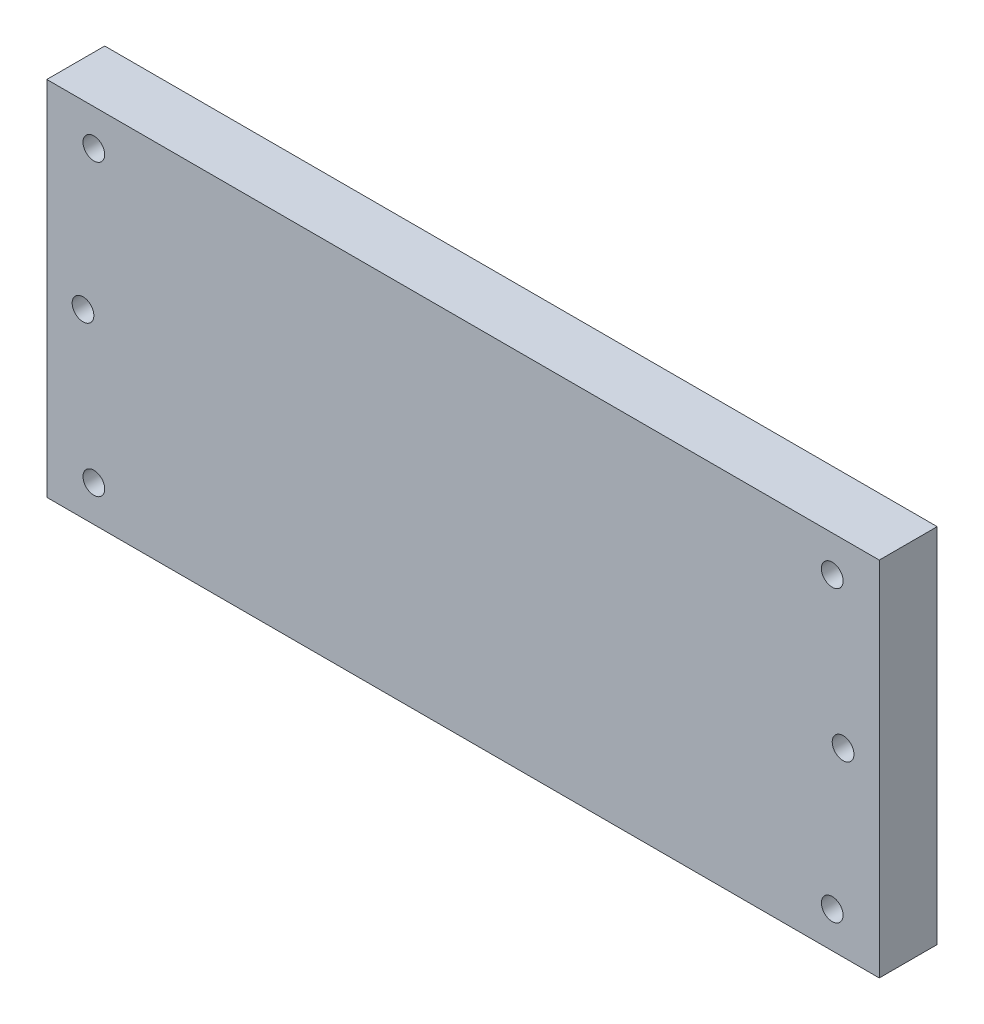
from build123d import *

# Parameters (mm, degrees)
ESQUISSE1_W             = 115
ESQUISSE1_H             = 50
BOSS_EXTRU_1_DEPTH      = 8
ESQUISSE2_R             = 4
ENL_V_MAT_EXTRU_1_DEPTH = 4
ESQUISSE3_R             = 1.5
ENL_V_MAT_EXTRU_2_DEPTH = 10


with BuildPart() as part:
    # Esquisse1 → Boss.-Extru.1 (new body)
    with BuildSketch(Plane.XY):
        with Locations((23.768377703, 3.093300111)):
            Rectangle(ESQUISSE1_W, ESQUISSE1_H)
    extrude(amount=BOSS_EXTRU_1_DEPTH)

    # Esquisse2 → Enl_v. mat.-Extru.1 (cut)
    with BuildSketch(Plane(origin=(0, 0, 0), x_dir=(-1, 0, 0), z_dir=(0, 0, -1))):
        with Locations((-76.268377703, 3.0933001)):
            Circle(ESQUISSE2_R)
        with Locations((28.731622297, 3.0933001)):
            Circle(ESQUISSE2_R)
    extrude(amount=-ENL_V_MAT_EXTRU_1_DEPTH, mode=Mode.SUBTRACT)

    # Esquisse3 → Enl_v. mat.-Extru.2 (cut)
    with BuildSketch(Plane.XY.offset(8)):
        with Locations((-27.231622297, 23.093300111)):
            Circle(ESQUISSE3_R)
        with Locations((-27.231622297, -16.906699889)):
            Circle(ESQUISSE3_R)
        with Locations((74.768377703, 23.093300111)):
            Circle(ESQUISSE3_R)
        with Locations((74.768377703, -16.906699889)):
            Circle(ESQUISSE3_R)
        with Locations((-28.731622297, 3.0933001)):
            Circle(ESQUISSE3_R)
        with Locations((76.268377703, 3.0933001)):
            Circle(ESQUISSE3_R)
    extrude(amount=-ENL_V_MAT_EXTRU_2_DEPTH, mode=Mode.SUBTRACT)


solid = part.part
